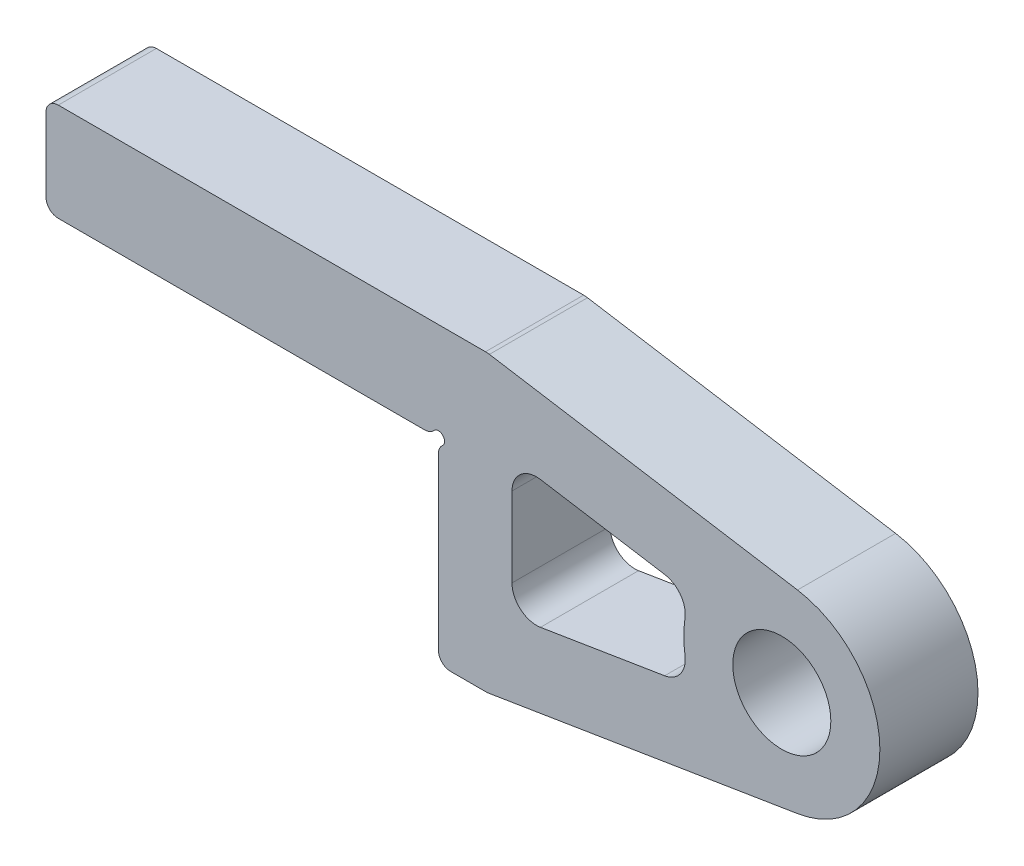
from build123d import *

# Parameters (mm, degrees)
BOSS_EXTRUDE1_DEPTH                                 = 6.35
CBORE_FOR_00_BINDING_HEAD_MACHINE_SCREW_D           = 2.9464
CBORE_FOR_00_BINDING_HEAD_MACHINE_SCREW_DEPTH       = 9.525
CBORE_FOR_00_BINDING_HEAD_MACHINE_SCREW_CBORE_D     = 5.588
CBORE_FOR_00_BINDING_HEAD_MACHINE_SCREW_CBORE_DEPTH = 2.794
CBORE_FOR_00_BINDING_HEAD_MACHINE_SCREW_TIP         = 0.885187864
SKETCH7_R                                           = 6.35
CUT_EXTRUDE1_DEPTH                                  = 108.200338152
FILLET1_R                                           = 3.175
FILLET2_R                                           = 1.5875
SKETCH8_R                                           = 0.79375
CUT_EXTRUDE2_DEPTH                                  = 90.352420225
FILLET3_R                                           = 1.5875


with BuildPart() as part:
    # Sketch1 → Boss-Extrude1 (new, symmetric)
    with BuildSketch(Plane.XY):
        Polygon((-25.4, -6.35), (25.4, -6.35), (25.4, -31.75), (101.6, -31.75), (101.6, 6.35), (25.4, 6.35), (-25.4, 6.35), align=None)
    extrude(amount=BOSS_EXTRUDE1_DEPTH, both=True)

    # CBORE for _00 Binding Head Machine Screw
    with Locations(Plane(origin=(0, -6.35, 0), x_dir=(-1, 0, 0), z_dir=(0, -1, 0))):
        with Locations((12.7, 0), (-12.7, 0)):
            CounterBoreHole(CBORE_FOR_00_BINDING_HEAD_MACHINE_SCREW_D / 2, CBORE_FOR_00_BINDING_HEAD_MACHINE_SCREW_CBORE_D / 2, CBORE_FOR_00_BINDING_HEAD_MACHINE_SCREW_CBORE_DEPTH, depth=CBORE_FOR_00_BINDING_HEAD_MACHINE_SCREW_DEPTH)
            with Locations((0, 0, -(CBORE_FOR_00_BINDING_HEAD_MACHINE_SCREW_DEPTH + CBORE_FOR_00_BINDING_HEAD_MACHINE_SCREW_TIP / 2))):  # 118° drill point
                Cone(0, CBORE_FOR_00_BINDING_HEAD_MACHINE_SCREW_D / 2, CBORE_FOR_00_BINDING_HEAD_MACHINE_SCREW_TIP, mode=Mode.SUBTRACT)

    # Sketch7 → Cut-Extrude1 (cut, through all)
    with BuildSketch(Plane.XY.offset(6.35)):
        with BuildLine():
            Line((71.884645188, -25.235957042), (32.002677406, -31.708989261))
            ThreePointArc((32.002677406, -31.708989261), (31.74917204, -31.739730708), (31.494016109, -31.75))
            Line((31.494016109, -31.75), (101.6, -31.75))
            Line((101.6, -31.75), (101.6, 6.35))
            Line((101.6, 6.35), (31.494016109, 6.35))
            ThreePointArc((31.494016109, 6.35), (31.74917204, 6.339730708), (32.002677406, 6.308989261))
            Line((32.002677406, 6.308989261), (71.884645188, -0.164042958))
            ThreePointArc((71.884645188, -0.164042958), (82.55, -12.7), (71.884645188, -25.235957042))
        make_face()
        with BuildLine():
            Line((38.608661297, -20.987164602), (58.220773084, -17.804025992))
            ThreePointArc((58.220773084, -17.804025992), (57.15, -12.7), (58.220773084, -7.595974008))
            Line((58.220773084, -7.595974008), (38.608661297, -4.412835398))
            ThreePointArc((38.608661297, -4.412835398), (36.042619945, -5.128599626), (34.925, -7.546824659))
            Line((34.925, -7.546824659), (34.925, -17.853175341))
            ThreePointArc((34.925, -17.853175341), (36.042619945, -20.271400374), (38.608661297, -20.987164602))
        make_face()
        with Locations((69.85, -12.7)):
            Circle(SKETCH7_R)
    extrude(amount=-CUT_EXTRUDE1_DEPTH, mode=Mode.SUBTRACT)

    # Fillet1
    fillet1_edges = [part.edges().sort_by_distance(p)[0] for p in [
        (58.220773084, -7.595974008, 0),
        (58.220773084, -17.804025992, 0),
    ]]
    fillet(fillet1_edges, radius=FILLET1_R)

    # Fillet2
    fillet2_edges = [part.edges().sort_by_distance(p)[0] for p in [
        (25.4, -31.75, 0),
        (-25.4, -6.35, 0),
        (-25.4, 6.35, 0),
    ]]
    fillet(fillet2_edges, radius=FILLET2_R)

    # Sketch8 → Cut-Extrude2 (cut, through all)
    with BuildSketch(Plane.XY.offset(6.35)):
        with Locations((25.4, -6.35)):
            Circle(SKETCH8_R)
    extrude(amount=-CUT_EXTRUDE2_DEPTH, mode=Mode.SUBTRACT)

    # Fillet3
    fillet3_edges = [part.edges().sort_by_distance(p)[0] for p in [
        (25.4, -7.14375, 0),
        (24.60625, -6.35, 0),
    ]]
    fillet(fillet3_edges, radius=FILLET3_R)


solid = part.part
